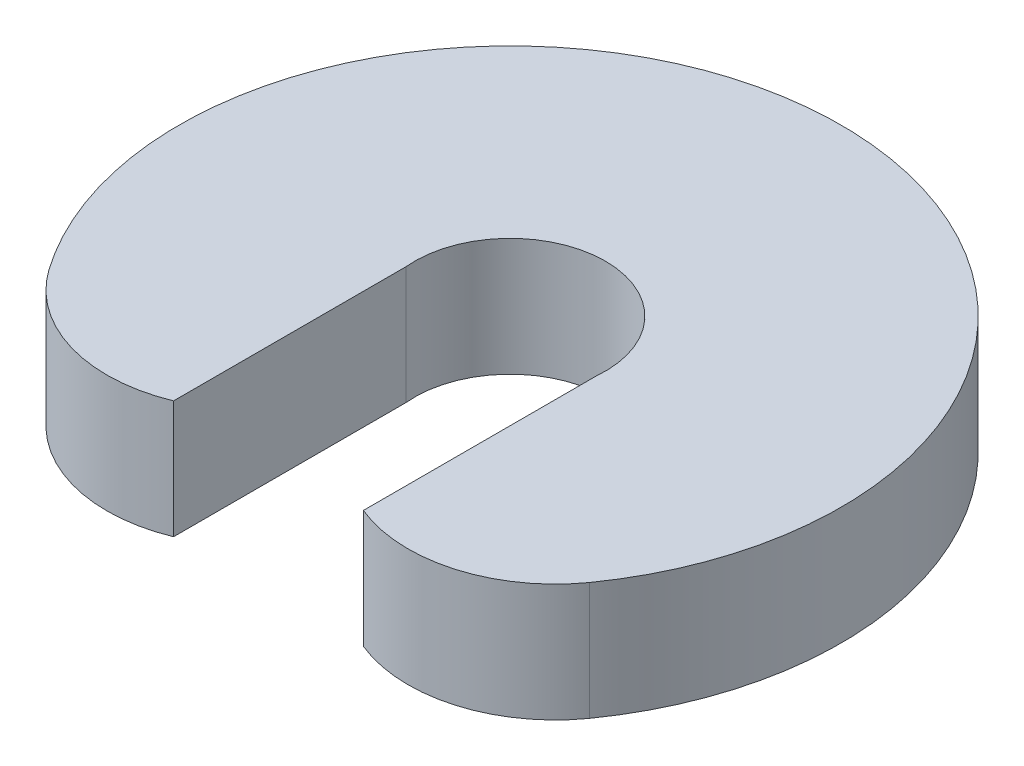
ISO-10303-21;
HEADER;
FILE_DESCRIPTION(('STEP AP214'),'2;1');
FILE_NAME('part.step','',(''),(''),'','','');
FILE_SCHEMA(('AUTOMOTIVE_DESIGN { 1 0 10303 214 1 1 1 1 }'));
ENDSEC;
DATA;
#1=APPLICATION_CONTEXT('core data for automotive mechanical design processes');
#2=APPLICATION_PROTOCOL_DEFINITION('international standard','automotive_design',2000,#1);
#3=PRODUCT_CONTEXT('',#1,'mechanical');
#4=PRODUCT('Part','Part','',(#3));
#5=PRODUCT_RELATED_PRODUCT_CATEGORY('part','',(#4));
#6=PRODUCT_DEFINITION_FORMATION('','',#4);
#7=PRODUCT_DEFINITION_CONTEXT('part definition',#1,'design');
#8=PRODUCT_DEFINITION('design','',#6,#7);
#9=PRODUCT_DEFINITION_SHAPE('','',#8);
#10=(LENGTH_UNIT() NAMED_UNIT(*) SI_UNIT(.MILLI.,.METRE.));
#11=(NAMED_UNIT(*) PLANE_ANGLE_UNIT() SI_UNIT($,.RADIAN.));
#12=(NAMED_UNIT(*) SI_UNIT($,.STERADIAN.) SOLID_ANGLE_UNIT());
#13=UNCERTAINTY_MEASURE_WITH_UNIT(LENGTH_MEASURE(1.E-05),#10,'distance_accuracy_value','');
#14=(GEOMETRIC_REPRESENTATION_CONTEXT(3) GLOBAL_UNCERTAINTY_ASSIGNED_CONTEXT((#13)) GLOBAL_UNIT_ASSIGNED_CONTEXT((#10,
#11,#12)) REPRESENTATION_CONTEXT('',''));
#15=CARTESIAN_POINT('',(0.,0.,0.));
#16=DIRECTION('',(0.,0.,1.));
#17=DIRECTION('',(1.,0.,0.));
#18=AXIS2_PLACEMENT_3D('',#15,#16,#17);
#19=CARTESIAN_POINT('',(0.,80.,0.));
#20=DIRECTION('',(0.,-1.,0.));
#21=DIRECTION('',(0.,0.,-1.));
#22=AXIS2_PLACEMENT_3D('',#19,#20,#21);
#23=CYLINDRICAL_SURFACE('',#22,225.);
#24=CARTESIAN_POINT('',(0.,0.,0.));
#25=DIRECTION('',(0.,1.,0.));
#26=DIRECTION('',(1.,0.,0.));
#27=AXIS2_PLACEMENT_3D('',#24,#25,#26);
#28=CIRCLE('',#27,225.);
#29=CARTESIAN_POINT('',(183.716642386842,0.,129.896864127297));
#30=VERTEX_POINT('',#29);
#31=CARTESIAN_POINT('',(-183.716642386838,0.,129.896864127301));
#32=VERTEX_POINT('',#31);
#33=EDGE_CURVE('E11',#30,#32,#28,.T.);
#34=ORIENTED_EDGE('',*,*,#33,.T.);
#35=DIRECTION('',(0.,-1.,0.));
#36=VECTOR('',#35,1.);
#37=CARTESIAN_POINT('',(-183.716642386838,80.,129.896864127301));
#38=LINE('',#37,#36);
#39=CARTESIAN_POINT('',(-183.716642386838,80.,129.896864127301));
#40=VERTEX_POINT('',#39);
#41=EDGE_CURVE('E40',#40,#32,#38,.T.);
#42=ORIENTED_EDGE('',*,*,#41,.F.);
#43=CARTESIAN_POINT('',(0.,80.,0.));
#44=DIRECTION('',(0.,1.,0.));
#45=DIRECTION('',(1.,0.,0.));
#46=AXIS2_PLACEMENT_3D('',#43,#44,#45);
#47=CIRCLE('',#46,225.);
#48=CARTESIAN_POINT('',(183.716642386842,80.,129.896864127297));
#49=VERTEX_POINT('',#48);
#50=EDGE_CURVE('E19',#49,#40,#47,.T.);
#51=ORIENTED_EDGE('',*,*,#50,.F.);
#52=DIRECTION('',(0.,-1.,0.));
#53=VECTOR('',#52,1.);
#54=CARTESIAN_POINT('',(183.716642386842,80.,129.896864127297));
#55=LINE('',#54,#53);
#56=EDGE_CURVE('E26',#49,#30,#55,.T.);
#57=ORIENTED_EDGE('',*,*,#56,.T.);
#58=EDGE_LOOP('',(#34,#42,#51,#57));
#59=FACE_BOUND('',#58,.T.);
#60=ADVANCED_FACE('F16',(#59),#23,.T.);
#61=CARTESIAN_POINT('',(-102.394005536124,80.,71.6970545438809));
#62=DIRECTION('',(0.,-1.,0.));
#63=DIRECTION('',(0.,0.,-1.));
#64=AXIS2_PLACEMENT_3D('',#61,#62,#63);
#65=CYLINDRICAL_SURFACE('',#64,100.002945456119);
#66=CARTESIAN_POINT('',(-102.394005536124,0.,71.6970545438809));
#67=DIRECTION('',(0.,1.,0.));
#68=DIRECTION('',(1.,0.,0.));
#69=AXIS2_PLACEMENT_3D('',#66,#67,#68);
#70=CIRCLE('',#69,100.002945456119);
#71=CARTESIAN_POINT('',(-64.5,0.,164.242359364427));
#72=VERTEX_POINT('',#71);
#73=EDGE_CURVE('E133',#32,#72,#70,.T.);
#74=ORIENTED_EDGE('',*,*,#73,.T.);
#75=DIRECTION('',(0.,-1.,0.));
#76=VECTOR('',#75,1.);
#77=CARTESIAN_POINT('',(-64.5,80.,164.242359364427));
#78=LINE('',#77,#76);
#79=CARTESIAN_POINT('',(-64.5,80.,164.242359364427));
#80=VERTEX_POINT('',#79);
#81=EDGE_CURVE('E102',#80,#72,#78,.T.);
#82=ORIENTED_EDGE('',*,*,#81,.F.);
#83=CARTESIAN_POINT('',(-102.394005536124,80.,71.6970545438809));
#84=DIRECTION('',(0.,1.,0.));
#85=DIRECTION('',(1.,0.,0.));
#86=AXIS2_PLACEMENT_3D('',#83,#84,#85);
#87=CIRCLE('',#86,100.002945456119);
#88=EDGE_CURVE('E116',#40,#80,#87,.T.);
#89=ORIENTED_EDGE('',*,*,#88,.F.);
#90=ORIENTED_EDGE('',*,*,#41,.T.);
#91=EDGE_LOOP('',(#74,#82,#89,#90));
#92=FACE_BOUND('',#91,.T.);
#93=ADVANCED_FACE('F253',(#92),#65,.T.);
#94=CARTESIAN_POINT('',(-64.5,80.,164.242359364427));
#95=DIRECTION('',(-1.,0.,0.));
#96=DIRECTION('',(0.,0.,1.));
#97=AXIS2_PLACEMENT_3D('',#94,#95,#96);
#98=PLANE('',#97);
#99=DIRECTION('',(0.,0.,-1.));
#100=VECTOR('',#99,1.);
#101=CARTESIAN_POINT('',(-64.5,0.,164.242359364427));
#102=LINE('',#101,#100);
#103=CARTESIAN_POINT('',(-64.5,0.,6.22816184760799));
#104=VERTEX_POINT('',#103);
#105=EDGE_CURVE('E122',#72,#104,#102,.T.);
#106=ORIENTED_EDGE('',*,*,#105,.T.);
#107=DIRECTION('',(0.,-1.,0.));
#108=VECTOR('',#107,1.);
#109=CARTESIAN_POINT('',(-64.5,80.,6.22816184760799));
#110=LINE('',#109,#108);
#111=CARTESIAN_POINT('',(-64.5,80.,6.22816184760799));
#112=VERTEX_POINT('',#111);
#113=EDGE_CURVE('E103',#112,#104,#110,.T.);
#114=ORIENTED_EDGE('',*,*,#113,.F.);
#115=DIRECTION('',(0.,0.,-1.));
#116=VECTOR('',#115,1.);
#117=CARTESIAN_POINT('',(-64.5,80.,164.242359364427));
#118=LINE('',#117,#116);
#119=EDGE_CURVE('E99',#80,#112,#118,.T.);
#120=ORIENTED_EDGE('',*,*,#119,.F.);
#121=ORIENTED_EDGE('',*,*,#81,.T.);
#122=EDGE_LOOP('',(#106,#114,#120,#121));
#123=FACE_BOUND('',#122,.T.);
#124=ADVANCED_FACE('F244',(#123),#98,.F.);
#125=CARTESIAN_POINT('',(0.,80.,0.));
#126=DIRECTION('',(0.,-1.,0.));
#127=DIRECTION('',(0.,0.,-1.));
#128=AXIS2_PLACEMENT_3D('',#125,#126,#127);
#129=CYLINDRICAL_SURFACE('',#128,64.8);
#130=CARTESIAN_POINT('',(0.,0.,0.));
#131=DIRECTION('',(0.,1.,0.));
#132=DIRECTION('',(1.,0.,0.));
#133=AXIS2_PLACEMENT_3D('',#130,#131,#132);
#134=CIRCLE('',#133,64.8);
#135=CARTESIAN_POINT('',(64.5,0.,6.22816184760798));
#136=VERTEX_POINT('',#135);
#137=EDGE_CURVE('E84',#136,#104,#134,.T.);
#138=ORIENTED_EDGE('',*,*,#137,.F.);
#139=DIRECTION('',(0.,-1.,0.));
#140=VECTOR('',#139,1.);
#141=CARTESIAN_POINT('',(64.5,80.,6.22816184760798));
#142=LINE('',#141,#140);
#143=CARTESIAN_POINT('',(64.5,80.,6.22816184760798));
#144=VERTEX_POINT('',#143);
#145=EDGE_CURVE('E79',#144,#136,#142,.T.);
#146=ORIENTED_EDGE('',*,*,#145,.F.);
#147=CARTESIAN_POINT('',(0.,80.,0.));
#148=DIRECTION('',(0.,1.,0.));
#149=DIRECTION('',(1.,0.,0.));
#150=AXIS2_PLACEMENT_3D('',#147,#148,#149);
#151=CIRCLE('',#150,64.8);
#152=EDGE_CURVE('E82',#144,#112,#151,.T.);
#153=ORIENTED_EDGE('',*,*,#152,.T.);
#154=ORIENTED_EDGE('',*,*,#113,.T.);
#155=EDGE_LOOP('',(#138,#146,#153,#154));
#156=FACE_BOUND('',#155,.T.);
#157=ADVANCED_FACE('F81',(#156),#129,.F.);
#158=CARTESIAN_POINT('',(64.5,80.,6.22816184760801));
#159=DIRECTION('',(1.,0.,0.));
#160=DIRECTION('',(0.,1.,0.));
#161=AXIS2_PLACEMENT_3D('',#158,#159,#160);
#162=PLANE('',#161);
#163=DIRECTION('',(0.,0.,1.));
#164=VECTOR('',#163,1.);
#165=CARTESIAN_POINT('',(64.5,0.,6.22816184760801));
#166=LINE('',#165,#164);
#167=CARTESIAN_POINT('',(64.5,0.,164.242359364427));
#168=VERTEX_POINT('',#167);
#169=EDGE_CURVE('E90',#136,#168,#166,.T.);
#170=ORIENTED_EDGE('',*,*,#169,.T.);
#171=DIRECTION('',(0.,-1.,0.));
#172=VECTOR('',#171,1.);
#173=CARTESIAN_POINT('',(64.5,80.,164.242359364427));
#174=LINE('',#173,#172);
#175=CARTESIAN_POINT('',(64.5,80.,164.242359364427));
#176=VERTEX_POINT('',#175);
#177=EDGE_CURVE('E106',#176,#168,#174,.T.);
#178=ORIENTED_EDGE('',*,*,#177,.F.);
#179=DIRECTION('',(0.,0.,1.));
#180=VECTOR('',#179,1.);
#181=CARTESIAN_POINT('',(64.5,80.,6.22816184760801));
#182=LINE('',#181,#180);
#183=EDGE_CURVE('E95',#144,#176,#182,.T.);
#184=ORIENTED_EDGE('',*,*,#183,.F.);
#185=ORIENTED_EDGE('',*,*,#145,.T.);
#186=EDGE_LOOP('',(#170,#178,#184,#185));
#187=FACE_BOUND('',#186,.T.);
#188=ADVANCED_FACE('F105',(#187),#162,.F.);
#189=CARTESIAN_POINT('',(102.394005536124,80.,71.6970545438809));
#190=DIRECTION('',(0.,-1.,0.));
#191=DIRECTION('',(0.,0.,-1.));
#192=AXIS2_PLACEMENT_3D('',#189,#190,#191);
#193=CYLINDRICAL_SURFACE('',#192,100.002945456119);
#194=CARTESIAN_POINT('',(102.394005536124,0.,71.6970545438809));
#195=DIRECTION('',(0.,1.,0.));
#196=DIRECTION('',(1.,0.,0.));
#197=AXIS2_PLACEMENT_3D('',#194,#195,#196);
#198=CIRCLE('',#197,100.002945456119);
#199=EDGE_CURVE('E91',#168,#30,#198,.T.);
#200=ORIENTED_EDGE('',*,*,#199,.T.);
#201=ORIENTED_EDGE('',*,*,#56,.F.);
#202=CARTESIAN_POINT('',(102.394005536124,80.,71.6970545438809));
#203=DIRECTION('',(0.,1.,0.));
#204=DIRECTION('',(1.,0.,0.));
#205=AXIS2_PLACEMENT_3D('',#202,#203,#204);
#206=CIRCLE('',#205,100.002945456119);
#207=EDGE_CURVE('E109',#176,#49,#206,.T.);
#208=ORIENTED_EDGE('',*,*,#207,.F.);
#209=ORIENTED_EDGE('',*,*,#177,.T.);
#210=EDGE_LOOP('',(#200,#201,#208,#209));
#211=FACE_BOUND('',#210,.T.);
#212=ADVANCED_FACE('F155',(#211),#193,.T.);
#213=CARTESIAN_POINT('',(0.,80.,0.));
#214=DIRECTION('',(0.,1.,0.));
#215=DIRECTION('',(1.,0.,0.));
#216=AXIS2_PLACEMENT_3D('',#213,#214,#215);
#217=PLANE('',#216);
#218=ORIENTED_EDGE('',*,*,#50,.T.);
#219=ORIENTED_EDGE('',*,*,#88,.T.);
#220=ORIENTED_EDGE('',*,*,#119,.T.);
#221=ORIENTED_EDGE('',*,*,#152,.F.);
#222=ORIENTED_EDGE('',*,*,#183,.T.);
#223=ORIENTED_EDGE('',*,*,#207,.T.);
#224=EDGE_LOOP('',(#218,#219,#220,#221,#222,#223));
#225=FACE_BOUND('',#224,.T.);
#226=ADVANCED_FACE('F93',(#225),#217,.T.);
#227=CARTESIAN_POINT('',(0.,0.,0.));
#228=DIRECTION('',(0.,1.,0.));
#229=DIRECTION('',(1.,0.,0.));
#230=AXIS2_PLACEMENT_3D('',#227,#228,#229);
#231=PLANE('',#230);
#232=ORIENTED_EDGE('',*,*,#33,.F.);
#233=ORIENTED_EDGE('',*,*,#199,.F.);
#234=ORIENTED_EDGE('',*,*,#169,.F.);
#235=ORIENTED_EDGE('',*,*,#137,.T.);
#236=ORIENTED_EDGE('',*,*,#105,.F.);
#237=ORIENTED_EDGE('',*,*,#73,.F.);
#238=EDGE_LOOP('',(#232,#233,#234,#235,#236,#237));
#239=FACE_BOUND('',#238,.T.);
#240=ADVANCED_FACE('F151',(#239),#231,.F.);
#241=CLOSED_SHELL('',(#60,#93,#124,#157,#188,#212,#226,#240));
#242=MANIFOLD_SOLID_BREP('B1',#241);
#243=ADVANCED_BREP_SHAPE_REPRESENTATION('',(#18,#242),#14);
#244=SHAPE_DEFINITION_REPRESENTATION(#9,#243);
ENDSEC;
END-ISO-10303-21;
